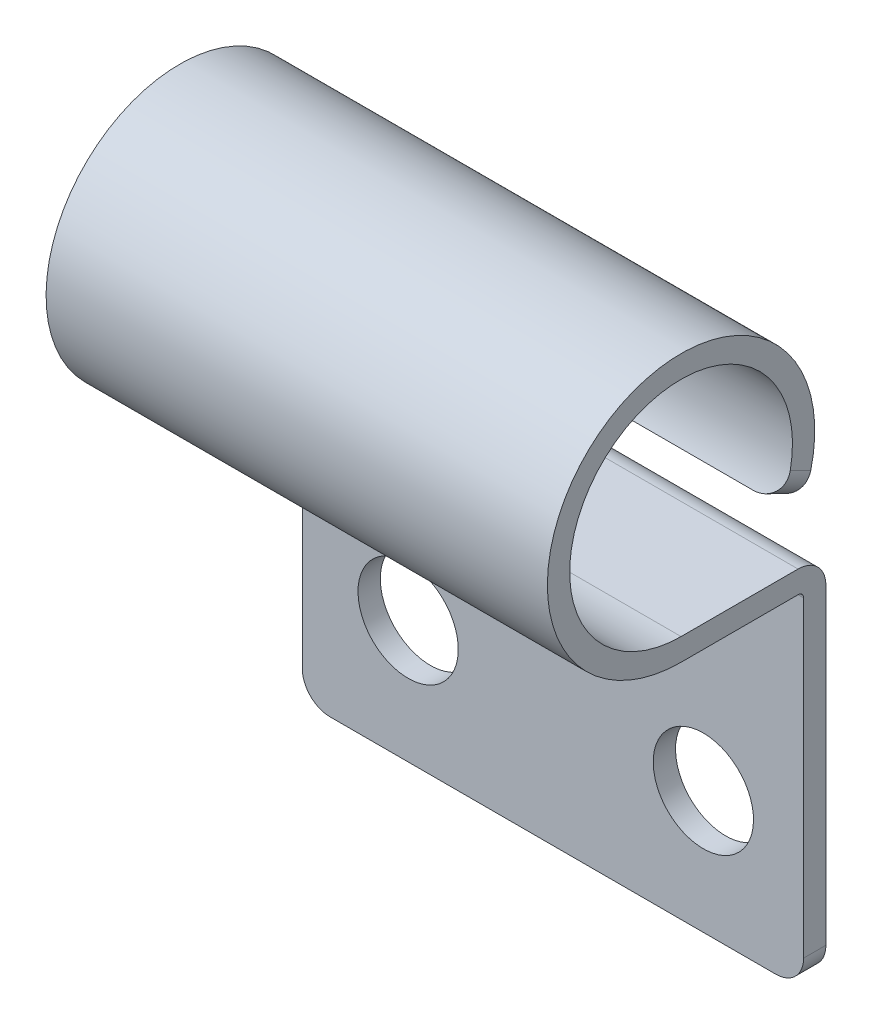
ISO-10303-21;
HEADER;
FILE_DESCRIPTION(('STEP AP214'),'2;1');
FILE_NAME('part.step','',(''),(''),'','','');
FILE_SCHEMA(('AUTOMOTIVE_DESIGN { 1 0 10303 214 1 1 1 1 }'));
ENDSEC;
DATA;
#1=APPLICATION_CONTEXT('core data for automotive mechanical design processes');
#2=APPLICATION_PROTOCOL_DEFINITION('international standard','automotive_design',2000,#1);
#3=PRODUCT_CONTEXT('',#1,'mechanical');
#4=PRODUCT('Part','Part','',(#3));
#5=PRODUCT_RELATED_PRODUCT_CATEGORY('part','',(#4));
#6=PRODUCT_DEFINITION_FORMATION('','',#4);
#7=PRODUCT_DEFINITION_CONTEXT('part definition',#1,'design');
#8=PRODUCT_DEFINITION('design','',#6,#7);
#9=PRODUCT_DEFINITION_SHAPE('','',#8);
#10=(LENGTH_UNIT() NAMED_UNIT(*) SI_UNIT(.MILLI.,.METRE.));
#11=(NAMED_UNIT(*) PLANE_ANGLE_UNIT() SI_UNIT($,.RADIAN.));
#12=(NAMED_UNIT(*) SI_UNIT($,.STERADIAN.) SOLID_ANGLE_UNIT());
#13=UNCERTAINTY_MEASURE_WITH_UNIT(LENGTH_MEASURE(1.E-05),#10,'distance_accuracy_value','');
#14=(GEOMETRIC_REPRESENTATION_CONTEXT(3) GLOBAL_UNCERTAINTY_ASSIGNED_CONTEXT((#13)) GLOBAL_UNIT_ASSIGNED_CONTEXT((#10,
#11,#12)) REPRESENTATION_CONTEXT('',''));
#15=CARTESIAN_POINT('',(0.,0.,0.));
#16=DIRECTION('',(0.,0.,1.));
#17=DIRECTION('',(1.,0.,0.));
#18=AXIS2_PLACEMENT_3D('',#15,#16,#17);
#19=CARTESIAN_POINT('',(9.,-2.5,-2.2));
#20=DIRECTION('',(0.,0.,-1.));
#21=DIRECTION('',(0.,1.,0.));
#22=AXIS2_PLACEMENT_3D('',#19,#20,#21);
#23=PLANE('',#22);
#24=CARTESIAN_POINT('',(4.45,-3.7,-2.2));
#25=DIRECTION('',(0.,0.,-1.));
#26=DIRECTION('',(0.,1.,0.));
#27=AXIS2_PLACEMENT_3D('',#24,#25,#26);
#28=CIRCLE('',#27,0.7);
#29=CARTESIAN_POINT('',(4.45,-3.,-2.2));
#30=VERTEX_POINT('',#29);
#31=EDGE_CURVE('E343',#30,#30,#28,.T.);
#32=ORIENTED_EDGE('',*,*,#31,.T.);
#33=EDGE_LOOP('',(#32));
#34=FACE_BOUND('',#33,.T.);
#35=CARTESIAN_POINT('',(7.2,-6.4,-2.2));
#36=DIRECTION('',(0.,0.,-1.));
#37=DIRECTION('',(0.,1.,0.));
#38=AXIS2_PLACEMENT_3D('',#35,#36,#37);
#39=CIRCLE('',#38,0.899999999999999);
#40=CARTESIAN_POINT('',(7.2,-5.5,-2.2));
#41=VERTEX_POINT('',#40);
#42=EDGE_CURVE('E337',#41,#41,#39,.T.);
#43=ORIENTED_EDGE('',*,*,#42,.T.);
#44=EDGE_LOOP('',(#43));
#45=FACE_BOUND('',#44,.T.);
#46=CARTESIAN_POINT('',(1.9,-6.4,-2.2));
#47=DIRECTION('',(0.,0.,-1.));
#48=DIRECTION('',(0.,1.,0.));
#49=AXIS2_PLACEMENT_3D('',#46,#47,#48);
#50=CIRCLE('',#49,0.9);
#51=CARTESIAN_POINT('',(1.9,-5.5,-2.2));
#52=VERTEX_POINT('',#51);
#53=EDGE_CURVE('E176',#52,#52,#50,.T.);
#54=ORIENTED_EDGE('',*,*,#53,.T.);
#55=EDGE_LOOP('',(#54));
#56=FACE_BOUND('',#55,.T.);
#57=DIRECTION('',(0.,-1.,0.));
#58=VECTOR('',#57,1.);
#59=CARTESIAN_POINT('',(0.,-2.5,-2.2));
#60=LINE('',#59,#58);
#61=CARTESIAN_POINT('',(0.,-2.5,-2.2));
#62=VERTEX_POINT('',#61);
#63=CARTESIAN_POINT('',(0.,-8.1,-2.2));
#64=VERTEX_POINT('',#63);
#65=EDGE_CURVE('E173',#62,#64,#60,.T.);
#66=ORIENTED_EDGE('',*,*,#65,.T.);
#67=CARTESIAN_POINT('',(0.5,-8.1,-2.2));
#68=DIRECTION('',(0.,0.,-1.));
#69=DIRECTION('',(0.,1.,0.));
#70=AXIS2_PLACEMENT_3D('',#67,#68,#69);
#71=CIRCLE('',#70,0.5);
#72=CARTESIAN_POINT('',(0.5,-8.6,-2.2));
#73=VERTEX_POINT('',#72);
#74=EDGE_CURVE('E308',#64,#73,#71,.F.);
#75=ORIENTED_EDGE('',*,*,#74,.T.);
#76=DIRECTION('',(-1.,0.,0.));
#77=VECTOR('',#76,1.);
#78=CARTESIAN_POINT('',(9.,-8.6,-2.2));
#79=LINE('',#78,#77);
#80=CARTESIAN_POINT('',(8.5,-8.6,-2.2));
#81=VERTEX_POINT('',#80);
#82=EDGE_CURVE('E210',#81,#73,#79,.T.);
#83=ORIENTED_EDGE('',*,*,#82,.F.);
#84=CARTESIAN_POINT('',(8.5,-8.1,-2.2));
#85=DIRECTION('',(0.,0.,-1.));
#86=DIRECTION('',(0.,1.,0.));
#87=AXIS2_PLACEMENT_3D('',#84,#85,#86);
#88=CIRCLE('',#87,0.5);
#89=CARTESIAN_POINT('',(9.,-8.1,-2.2));
#90=VERTEX_POINT('',#89);
#91=EDGE_CURVE('E306',#81,#90,#88,.F.);
#92=ORIENTED_EDGE('',*,*,#91,.T.);
#93=DIRECTION('',(0.,-1.,0.));
#94=VECTOR('',#93,1.);
#95=CARTESIAN_POINT('',(9.,-2.5,-2.2));
#96=LINE('',#95,#94);
#97=CARTESIAN_POINT('',(9.,-2.5,-2.2));
#98=VERTEX_POINT('',#97);
#99=EDGE_CURVE('E156',#98,#90,#96,.T.);
#100=ORIENTED_EDGE('',*,*,#99,.F.);
#101=DIRECTION('',(-1.,0.,0.));
#102=VECTOR('',#101,1.);
#103=CARTESIAN_POINT('',(9.,-2.5,-2.2));
#104=LINE('',#103,#102);
#105=EDGE_CURVE('E172',#98,#62,#104,.T.);
#106=ORIENTED_EDGE('',*,*,#105,.T.);
#107=EDGE_LOOP('',(#66,#75,#83,#92,#100,#106));
#108=FACE_BOUND('',#107,.T.);
#109=ADVANCED_FACE('F34',(#34,#45,#56,#108),#23,.F.);
#110=CARTESIAN_POINT('',(9.,-8.6,-2.6));
#111=DIRECTION('',(0.,-1.,0.));
#112=DIRECTION('',(0.,0.,-1.));
#113=AXIS2_PLACEMENT_3D('',#110,#111,#112);
#114=PLANE('',#113);
#115=ORIENTED_EDGE('',*,*,#82,.T.);
#116=DIRECTION('',(0.,0.,1.));
#117=VECTOR('',#116,1.);
#118=CARTESIAN_POINT('',(0.5,-8.6,-2.6));
#119=LINE('',#118,#117);
#120=CARTESIAN_POINT('',(0.5,-8.6,-2.6));
#121=VERTEX_POINT('',#120);
#122=EDGE_CURVE('E49',#73,#121,#119,.F.);
#123=ORIENTED_EDGE('',*,*,#122,.T.);
#124=DIRECTION('',(-1.,0.,0.));
#125=VECTOR('',#124,1.);
#126=CARTESIAN_POINT('',(9.,-8.6,-2.6));
#127=LINE('',#126,#125);
#128=CARTESIAN_POINT('',(8.5,-8.6,-2.6));
#129=VERTEX_POINT('',#128);
#130=EDGE_CURVE('E143',#129,#121,#127,.T.);
#131=ORIENTED_EDGE('',*,*,#130,.F.);
#132=DIRECTION('',(0.,0.,1.));
#133=VECTOR('',#132,1.);
#134=CARTESIAN_POINT('',(8.5,-8.6,-2.2));
#135=LINE('',#134,#133);
#136=EDGE_CURVE('E312',#129,#81,#135,.T.);
#137=ORIENTED_EDGE('',*,*,#136,.T.);
#138=EDGE_LOOP('',(#115,#123,#131,#137));
#139=FACE_BOUND('',#138,.T.);
#140=ADVANCED_FACE('F275',(#139),#114,.T.);
#141=CARTESIAN_POINT('',(9.,-2.5,-2.6));
#142=DIRECTION('',(0.,0.,-1.));
#143=DIRECTION('',(0.,1.,0.));
#144=AXIS2_PLACEMENT_3D('',#141,#142,#143);
#145=PLANE('',#144);
#146=CARTESIAN_POINT('',(4.45,-3.7,-2.6));
#147=DIRECTION('',(0.,0.,-1.));
#148=DIRECTION('',(0.,1.,0.));
#149=AXIS2_PLACEMENT_3D('',#146,#147,#148);
#150=CIRCLE('',#149,0.7);
#151=CARTESIAN_POINT('',(4.45,-3.,-2.6));
#152=VERTEX_POINT('',#151);
#153=EDGE_CURVE('E345',#152,#152,#150,.T.);
#154=ORIENTED_EDGE('',*,*,#153,.F.);
#155=EDGE_LOOP('',(#154));
#156=FACE_BOUND('',#155,.T.);
#157=CARTESIAN_POINT('',(7.2,-6.4,-2.6));
#158=DIRECTION('',(0.,0.,-1.));
#159=DIRECTION('',(0.,1.,0.));
#160=AXIS2_PLACEMENT_3D('',#157,#158,#159);
#161=CIRCLE('',#160,0.899999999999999);
#162=CARTESIAN_POINT('',(7.2,-5.5,-2.6));
#163=VERTEX_POINT('',#162);
#164=EDGE_CURVE('E340',#163,#163,#161,.T.);
#165=ORIENTED_EDGE('',*,*,#164,.F.);
#166=EDGE_LOOP('',(#165));
#167=FACE_BOUND('',#166,.T.);
#168=CARTESIAN_POINT('',(1.9,-6.4,-2.6));
#169=DIRECTION('',(0.,0.,-1.));
#170=DIRECTION('',(0.,1.,0.));
#171=AXIS2_PLACEMENT_3D('',#168,#169,#170);
#172=CIRCLE('',#171,0.9);
#173=CARTESIAN_POINT('',(1.9,-5.5,-2.6));
#174=VERTEX_POINT('',#173);
#175=EDGE_CURVE('E334',#174,#174,#172,.T.);
#176=ORIENTED_EDGE('',*,*,#175,.F.);
#177=EDGE_LOOP('',(#176));
#178=FACE_BOUND('',#177,.T.);
#179=ORIENTED_EDGE('',*,*,#130,.T.);
#180=CARTESIAN_POINT('',(0.5,-8.1,-2.6));
#181=DIRECTION('',(0.,0.,-1.));
#182=DIRECTION('',(0.,1.,0.));
#183=AXIS2_PLACEMENT_3D('',#180,#181,#182);
#184=CIRCLE('',#183,0.5);
#185=CARTESIAN_POINT('',(0.,-8.1,-2.6));
#186=VERTEX_POINT('',#185);
#187=EDGE_CURVE('E11',#121,#186,#184,.T.);
#188=ORIENTED_EDGE('',*,*,#187,.T.);
#189=DIRECTION('',(0.,-1.,0.));
#190=VECTOR('',#189,1.);
#191=CARTESIAN_POINT('',(0.,-2.5,-2.6));
#192=LINE('',#191,#190);
#193=CARTESIAN_POINT('',(0.,-2.5,-2.6));
#194=VERTEX_POINT('',#193);
#195=EDGE_CURVE('E138',#194,#186,#192,.T.);
#196=ORIENTED_EDGE('',*,*,#195,.F.);
#197=DIRECTION('',(-1.,0.,0.));
#198=VECTOR('',#197,1.);
#199=CARTESIAN_POINT('',(9.,-2.5,-2.6));
#200=LINE('',#199,#198);
#201=CARTESIAN_POINT('',(9.,-2.5,-2.6));
#202=VERTEX_POINT('',#201);
#203=EDGE_CURVE('E133',#202,#194,#200,.T.);
#204=ORIENTED_EDGE('',*,*,#203,.F.);
#205=DIRECTION('',(0.,-1.,0.));
#206=VECTOR('',#205,1.);
#207=CARTESIAN_POINT('',(9.,-2.5,-2.6));
#208=LINE('',#207,#206);
#209=CARTESIAN_POINT('',(9.,-8.1,-2.6));
#210=VERTEX_POINT('',#209);
#211=EDGE_CURVE('E136',#202,#210,#208,.T.);
#212=ORIENTED_EDGE('',*,*,#211,.T.);
#213=CARTESIAN_POINT('',(8.5,-8.1,-2.6));
#214=DIRECTION('',(0.,0.,-1.));
#215=DIRECTION('',(0.,1.,0.));
#216=AXIS2_PLACEMENT_3D('',#213,#214,#215);
#217=CIRCLE('',#216,0.5);
#218=EDGE_CURVE('E42',#210,#129,#217,.T.);
#219=ORIENTED_EDGE('',*,*,#218,.T.);
#220=EDGE_LOOP('',(#179,#188,#196,#204,#212,#219));
#221=FACE_BOUND('',#220,.T.);
#222=ADVANCED_FACE('F135',(#156,#167,#178,#221),#145,.T.);
#223=CARTESIAN_POINT('',(9.,-2.5,-2.1));
#224=DIRECTION('',(-1.,0.,0.));
#225=DIRECTION('',(0.,0.,1.));
#226=AXIS2_PLACEMENT_3D('',#223,#224,#225);
#227=CYLINDRICAL_SURFACE('',#226,0.5);
#228=CARTESIAN_POINT('',(0.,-2.5,-2.1));
#229=DIRECTION('',(-1.,0.,0.));
#230=DIRECTION('',(0.,0.,1.));
#231=AXIS2_PLACEMENT_3D('',#228,#229,#230);
#232=CIRCLE('',#231,0.5);
#233=CARTESIAN_POINT('',(0.,-2.,-2.1));
#234=VERTEX_POINT('',#233);
#235=EDGE_CURVE('E178',#234,#194,#232,.T.);
#236=ORIENTED_EDGE('',*,*,#235,.F.);
#237=DIRECTION('',(-1.,0.,0.));
#238=VECTOR('',#237,1.);
#239=CARTESIAN_POINT('',(9.,-2.,-2.1));
#240=LINE('',#239,#238);
#241=CARTESIAN_POINT('',(9.,-2.,-2.1));
#242=VERTEX_POINT('',#241);
#243=EDGE_CURVE('E144',#242,#234,#240,.T.);
#244=ORIENTED_EDGE('',*,*,#243,.F.);
#245=CARTESIAN_POINT('',(9.,-2.5,-2.1));
#246=DIRECTION('',(-1.,0.,0.));
#247=DIRECTION('',(0.,0.,1.));
#248=AXIS2_PLACEMENT_3D('',#245,#246,#247);
#249=CIRCLE('',#248,0.5);
#250=EDGE_CURVE('E151',#242,#202,#249,.T.);
#251=ORIENTED_EDGE('',*,*,#250,.T.);
#252=ORIENTED_EDGE('',*,*,#203,.T.);
#253=EDGE_LOOP('',(#236,#244,#251,#252));
#254=FACE_BOUND('',#253,.T.);
#255=ADVANCED_FACE('F158',(#254),#227,.T.);
#256=CARTESIAN_POINT('',(9.,-2.,0.));
#257=DIRECTION('',(0.,1.,0.));
#258=DIRECTION('',(0.,0.,1.));
#259=AXIS2_PLACEMENT_3D('',#256,#257,#258);
#260=PLANE('',#259);
#261=DIRECTION('',(0.,0.,-1.));
#262=VECTOR('',#261,1.);
#263=CARTESIAN_POINT('',(0.,-2.,0.));
#264=LINE('',#263,#262);
#265=CARTESIAN_POINT('',(0.,-2.,0.));
#266=VERTEX_POINT('',#265);
#267=EDGE_CURVE('E180',#266,#234,#264,.T.);
#268=ORIENTED_EDGE('',*,*,#267,.F.);
#269=DIRECTION('',(-1.,0.,0.));
#270=VECTOR('',#269,1.);
#271=CARTESIAN_POINT('',(9.,-2.,0.));
#272=LINE('',#271,#270);
#273=CARTESIAN_POINT('',(9.,-2.,0.));
#274=VERTEX_POINT('',#273);
#275=EDGE_CURVE('E205',#274,#266,#272,.T.);
#276=ORIENTED_EDGE('',*,*,#275,.F.);
#277=DIRECTION('',(0.,0.,-1.));
#278=VECTOR('',#277,1.);
#279=CARTESIAN_POINT('',(9.,-2.,0.));
#280=LINE('',#279,#278);
#281=EDGE_CURVE('E159',#274,#242,#280,.T.);
#282=ORIENTED_EDGE('',*,*,#281,.T.);
#283=ORIENTED_EDGE('',*,*,#243,.T.);
#284=EDGE_LOOP('',(#268,#276,#282,#283));
#285=FACE_BOUND('',#284,.T.);
#286=ADVANCED_FACE('F272',(#285),#260,.T.);
#287=CARTESIAN_POINT('',(9.,0.,0.));
#288=DIRECTION('',(-1.,0.,0.));
#289=DIRECTION('',(0.,0.,1.));
#290=AXIS2_PLACEMENT_3D('',#287,#288,#289);
#291=CYLINDRICAL_SURFACE('',#290,2.);
#292=CARTESIAN_POINT('',(0.,0.,0.));
#293=DIRECTION('',(1.,0.,0.));
#294=DIRECTION('',(0.,0.,-1.));
#295=AXIS2_PLACEMENT_3D('',#292,#293,#294);
#296=CIRCLE('',#295,2.);
#297=CARTESIAN_POINT('',(0.,-0.399438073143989,-1.95970641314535));
#298=VERTEX_POINT('',#297);
#299=EDGE_CURVE('E183',#298,#266,#296,.T.);
#300=ORIENTED_EDGE('',*,*,#299,.F.);
#301=CARTESIAN_POINT('',(0.,-0.399438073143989,-1.95970641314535));
#302=CARTESIAN_POINT('',(-2.8812266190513E-05,-0.426918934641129,-1.95412802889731));
#303=CARTESIAN_POINT('',(0.00220990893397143,-0.45428363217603,-1.94792633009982));
#304=CARTESIAN_POINT('',(0.0111747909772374,-0.508024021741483,-1.93459398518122));
#305=CARTESIAN_POINT('',(0.0178996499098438,-0.534399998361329,-1.92746360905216));
#306=CARTESIAN_POINT('',(0.035802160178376,-0.585459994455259,-1.91257722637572));
#307=CARTESIAN_POINT('',(0.0469862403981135,-0.610141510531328,-1.90482032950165));
#308=CARTESIAN_POINT('',(0.0735320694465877,-0.657070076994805,-1.88914524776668));
#309=CARTESIAN_POINT('',(0.0888917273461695,-0.679318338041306,-1.88122714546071));
#310=CARTESIAN_POINT('',(0.123093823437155,-0.720479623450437,-1.86584714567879));
#311=CARTESIAN_POINT('',(0.141876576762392,-0.739440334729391,-1.85837997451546));
#312=CARTESIAN_POINT('',(0.182565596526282,-0.774025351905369,-1.84424363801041));
#313=CARTESIAN_POINT('',(0.204472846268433,-0.789648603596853,-1.83757472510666));
#314=CARTESIAN_POINT('',(0.250946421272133,-0.817316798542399,-1.8254379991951));
#315=CARTESIAN_POINT('',(0.275529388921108,-0.829337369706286,-1.81997842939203));
#316=CARTESIAN_POINT('',(0.32654351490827,-0.849424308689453,-1.81069082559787));
#317=CARTESIAN_POINT('',(0.352973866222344,-0.857492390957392,-1.80686208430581));
#318=CARTESIAN_POINT('',(0.399578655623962,-0.867891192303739,-1.80188484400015));
#319=CARTESIAN_POINT('',(0.419497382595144,-0.871185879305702,-1.80029044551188));
#320=CARTESIAN_POINT('',(0.459608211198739,-0.875580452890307,-1.79815468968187));
#321=CARTESIAN_POINT('',(0.479799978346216,-0.87668281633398,-1.79761214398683));
#322=CARTESIAN_POINT('',(0.5,-0.8766808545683,-1.79761805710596));
#323=B_SPLINE_CURVE_WITH_KNOTS('',3,(#301,#302,#303,#304,#305,#306,#307,#308,#309,#310,#311,
#312,#313,#314,#315,#316,#317,#318,#319,#320,#321,#322),.UNSPECIFIED.,.F.,.F.,(4,2,2,2,2,2,2,2,
2,2,4),(0.,0.0840428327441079,0.168061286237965,0.252201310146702,0.336299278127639,
0.419051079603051,0.501828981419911,0.585154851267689,0.668444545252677,0.729060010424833,
0.789606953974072),.UNSPECIFIED.);
#324=CARTESIAN_POINT('',(0.5,-0.8766808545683,-1.79761805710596));
#325=VERTEX_POINT('',#324);
#326=EDGE_CURVE('E225',#298,#325,#323,.T.);
#327=ORIENTED_EDGE('',*,*,#326,.T.);
#328=DIRECTION('',(-1.,0.,0.));
#329=VECTOR('',#328,1.);
#330=CARTESIAN_POINT('',(9.,-0.8766808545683,-1.79761805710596));
#331=LINE('',#330,#329);
#332=CARTESIAN_POINT('',(8.5,-0.8766808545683,-1.79761805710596));
#333=VERTEX_POINT('',#332);
#334=EDGE_CURVE('E202',#333,#325,#331,.T.);
#335=ORIENTED_EDGE('',*,*,#334,.F.);
#336=CARTESIAN_POINT('',(8.5,-0.8766808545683,-1.79761805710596));
#337=CARTESIAN_POINT('',(8.52811167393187,-0.876694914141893,-1.7975924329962));
#338=CARTESIAN_POINT('',(8.55621639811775,-0.874551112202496,-1.7986563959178));
#339=CARTESIAN_POINT('',(8.61161328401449,-0.866050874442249,-1.80277452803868));
#340=CARTESIAN_POINT('',(8.63890598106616,-0.859697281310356,-1.80582735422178));
#341=CARTESIAN_POINT('',(8.69193382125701,-0.842875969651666,-1.81373675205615));
#342=CARTESIAN_POINT('',(8.71766815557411,-0.832406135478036,-1.81859425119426));
#343=CARTESIAN_POINT('',(8.76682744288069,-0.807559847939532,-1.82976313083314));
#344=CARTESIAN_POINT('',(8.79025278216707,-0.793184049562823,-1.83607426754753));
#345=CARTESIAN_POINT('',(8.83406712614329,-0.760864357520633,-1.84970021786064));
#346=CARTESIAN_POINT('',(8.85446390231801,-0.742929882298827,-1.85701236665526));
#347=CARTESIAN_POINT('',(8.89170634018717,-0.703877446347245,-1.87216295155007));
#348=CARTESIAN_POINT('',(8.90855222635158,-0.682759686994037,-1.88000135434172));
#349=CARTESIAN_POINT('',(8.93806150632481,-0.638114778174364,-1.89561657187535));
#350=CARTESIAN_POINT('',(8.95076759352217,-0.614615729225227,-1.90339315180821));
#351=CARTESIAN_POINT('',(8.97192694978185,-0.56564482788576,-1.91851540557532));
#352=CARTESIAN_POINT('',(8.98038090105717,-0.540173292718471,-1.92586114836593));
#353=CARTESIAN_POINT('',(8.99110536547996,-0.495424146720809,-1.9377636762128));
#354=CARTESIAN_POINT('',(8.99445113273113,-0.476448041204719,-1.94251901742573));
#355=CARTESIAN_POINT('',(8.99889883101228,-0.438148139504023,-1.95151665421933));
#356=CARTESIAN_POINT('',(9.00000448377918,-0.418824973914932,-1.95575978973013));
#357=CARTESIAN_POINT('',(9.,-0.399438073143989,-1.95970641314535));
#358=B_SPLINE_CURVE_WITH_KNOTS('',3,(#336,#337,#338,#339,#340,#341,#342,#343,#344,#345,#346,
#347,#348,#349,#350,#351,#352,#353,#354,#355,#356,#357),.UNSPECIFIED.,.F.,.F.,(4,2,2,2,2,2,2,2,
2,2,4),(0.,0.0842234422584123,0.168390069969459,0.25260001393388,0.336795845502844,
0.420771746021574,0.50474233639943,0.587817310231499,0.670878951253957,0.730289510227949,
0.789601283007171),.UNSPECIFIED.);
#359=CARTESIAN_POINT('',(9.,-0.399438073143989,-1.95970641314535));
#360=VERTEX_POINT('',#359);
#361=EDGE_CURVE('E218',#333,#360,#358,.T.);
#362=ORIENTED_EDGE('',*,*,#361,.T.);
#363=CARTESIAN_POINT('',(9.,0.,0.));
#364=DIRECTION('',(1.,0.,0.));
#365=DIRECTION('',(0.,0.,-1.));
#366=AXIS2_PLACEMENT_3D('',#363,#364,#365);
#367=CIRCLE('',#366,2.);
#368=EDGE_CURVE('E161',#360,#274,#367,.T.);
#369=ORIENTED_EDGE('',*,*,#368,.T.);
#370=ORIENTED_EDGE('',*,*,#275,.T.);
#371=EDGE_LOOP('',(#300,#327,#335,#362,#369,#370));
#372=FACE_BOUND('',#371,.T.);
#373=ADVANCED_FACE('F231',(#372),#291,.F.);
#374=CARTESIAN_POINT('',(9.,-1.05201702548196,-2.15714166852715));
#375=DIRECTION('',(0.,-0.898809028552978,0.43834042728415));
#376=DIRECTION('',(0.,-0.438340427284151,-0.898809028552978));
#377=AXIS2_PLACEMENT_3D('',#374,#375,#376);
#378=PLANE('',#377);
#379=ORIENTED_EDGE('',*,*,#334,.T.);
#380=DIRECTION('',(0.,0.438340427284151,0.898809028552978));
#381=VECTOR('',#380,1.);
#382=CARTESIAN_POINT('',(0.5,-1.05201702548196,-2.15714166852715));
#383=LINE('',#382,#381);
#384=CARTESIAN_POINT('',(0.5,-1.05201702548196,-2.15714166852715));
#385=VERTEX_POINT('',#384);
#386=EDGE_CURVE('E253',#325,#385,#383,.F.);
#387=ORIENTED_EDGE('',*,*,#386,.T.);
#388=DIRECTION('',(-1.,0.,0.));
#389=VECTOR('',#388,1.);
#390=CARTESIAN_POINT('',(9.,-1.05201702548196,-2.15714166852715));
#391=LINE('',#390,#389);
#392=CARTESIAN_POINT('',(8.5,-1.05201702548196,-2.15714166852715));
#393=VERTEX_POINT('',#392);
#394=EDGE_CURVE('E199',#393,#385,#391,.T.);
#395=ORIENTED_EDGE('',*,*,#394,.F.);
#396=DIRECTION('',(0.,0.438340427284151,0.898809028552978));
#397=VECTOR('',#396,1.);
#398=CARTESIAN_POINT('',(8.5,-0.8766808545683,-1.79761805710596));
#399=LINE('',#398,#397);
#400=EDGE_CURVE('E385',#393,#333,#399,.T.);
#401=ORIENTED_EDGE('',*,*,#400,.T.);
#402=EDGE_LOOP('',(#379,#387,#395,#401));
#403=FACE_BOUND('',#402,.T.);
#404=ADVANCED_FACE('F263',(#403),#378,.T.);
#405=CARTESIAN_POINT('',(9.,0.,0.));
#406=DIRECTION('',(-1.,0.,0.));
#407=DIRECTION('',(0.,0.,1.));
#408=AXIS2_PLACEMENT_3D('',#405,#406,#407);
#409=CYLINDRICAL_SURFACE('',#408,2.4);
#410=ORIENTED_EDGE('',*,*,#394,.T.);
#411=CARTESIAN_POINT('',(0.5,-1.05201702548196,-2.15714166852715));
#412=CARTESIAN_POINT('',(0.471882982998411,-1.05203231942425,-2.15711856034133));
#413=CARTESIAN_POINT('',(0.443772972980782,-1.04988649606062,-2.1581804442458));
#414=CARTESIAN_POINT('',(0.388366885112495,-1.04138500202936,-2.16230372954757));
#415=CARTESIAN_POINT('',(0.361070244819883,-1.03503231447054,-2.16536371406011));
#416=CARTESIAN_POINT('',(0.30803540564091,-1.01822495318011,-2.17331518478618));
#417=CARTESIAN_POINT('',(0.282297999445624,-1.00776821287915,-2.17820759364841));
#418=CARTESIAN_POINT('',(0.233132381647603,-0.982976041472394,-2.1895077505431));
#419=CARTESIAN_POINT('',(0.209703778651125,-0.96864126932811,-2.19591524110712));
#420=CARTESIAN_POINT('',(0.165862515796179,-0.936434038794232,-2.20984100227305));
#421=CARTESIAN_POINT('',(0.145444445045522,-0.918568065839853,-2.21735723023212));
#422=CARTESIAN_POINT('',(0.108157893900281,-0.879699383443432,-2.23306232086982));
#423=CARTESIAN_POINT('',(0.0912894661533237,-0.858696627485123,-2.24125119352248));
#424=CARTESIAN_POINT('',(0.0616889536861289,-0.814254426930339,-2.25777479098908));
#425=CARTESIAN_POINT('',(0.04892722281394,-0.790834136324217,-2.26610799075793));
#426=CARTESIAN_POINT('',(0.0277016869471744,-0.742048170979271,-2.28254805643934));
#427=CARTESIAN_POINT('',(0.0192366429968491,-0.716683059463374,-2.29065498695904));
#428=CARTESIAN_POINT('',(0.00866524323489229,-0.67260109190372,-2.30390229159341));
#429=CARTESIAN_POINT('',(0.00540964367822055,-0.654196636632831,-2.30919767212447));
#430=CARTESIAN_POINT('',(0.00107687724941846,-0.617058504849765,-2.31939934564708));
#431=CARTESIAN_POINT('',(-3.7487074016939E-06,-0.598325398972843,-2.32430624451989));
#432=CARTESIAN_POINT('',(0.,-0.5795290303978,-2.32897962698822));
#433=B_SPLINE_CURVE_WITH_KNOTS('',3,(#411,#412,#413,#414,#415,#416,#417,#418,#419,#420,#421,
#422,#423,#424,#425,#426,#427,#428,#429,#430,#431,#432),.UNSPECIFIED.,.F.,.F.,(4,2,2,2,2,2,2,2,
2,2,4),(0.,0.0842393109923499,0.168418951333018,0.252641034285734,0.336848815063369,
0.420903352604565,0.504959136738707,0.588393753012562,0.671804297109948,0.729959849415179,
0.788022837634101),.UNSPECIFIED.);
#434=CARTESIAN_POINT('',(0.,-0.579529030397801,-2.32897962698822));
#435=VERTEX_POINT('',#434);
#436=EDGE_CURVE('E252',#385,#435,#433,.T.);
#437=ORIENTED_EDGE('',*,*,#436,.T.);
#438=CARTESIAN_POINT('',(0.,0.,0.));
#439=DIRECTION('',(1.,0.,0.));
#440=DIRECTION('',(0.,0.,-1.));
#441=AXIS2_PLACEMENT_3D('',#438,#439,#440);
#442=CIRCLE('',#441,2.4);
#443=CARTESIAN_POINT('',(0.,-2.4,0.));
#444=VERTEX_POINT('',#443);
#445=EDGE_CURVE('E185',#435,#444,#442,.T.);
#446=ORIENTED_EDGE('',*,*,#445,.T.);
#447=DIRECTION('',(-1.,0.,0.));
#448=VECTOR('',#447,1.);
#449=CARTESIAN_POINT('',(9.,-2.4,0.));
#450=LINE('',#449,#448);
#451=CARTESIAN_POINT('',(9.,-2.4,0.));
#452=VERTEX_POINT('',#451);
#453=EDGE_CURVE('E196',#452,#444,#450,.T.);
#454=ORIENTED_EDGE('',*,*,#453,.F.);
#455=CARTESIAN_POINT('',(9.,0.,0.));
#456=DIRECTION('',(1.,0.,0.));
#457=DIRECTION('',(0.,0.,-1.));
#458=AXIS2_PLACEMENT_3D('',#455,#456,#457);
#459=CIRCLE('',#458,2.4);
#460=CARTESIAN_POINT('',(9.,-0.579529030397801,-2.32897962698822));
#461=VERTEX_POINT('',#460);
#462=EDGE_CURVE('E166',#461,#452,#459,.T.);
#463=ORIENTED_EDGE('',*,*,#462,.F.);
#464=CARTESIAN_POINT('',(9.,-0.579529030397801,-2.32897962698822));
#465=CARTESIAN_POINT('',(9.000027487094,-0.606770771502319,-2.32222036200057));
#466=CARTESIAN_POINT('',(8.9977407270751,-0.633889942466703,-2.31494597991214));
#467=CARTESIAN_POINT('',(8.98862528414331,-0.687135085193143,-2.29969299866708));
#468=CARTESIAN_POINT('',(8.981798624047,-0.713261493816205,-2.2917147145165));
#469=CARTESIAN_POINT('',(8.96367934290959,-0.763827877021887,-2.27536389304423));
#470=CARTESIAN_POINT('',(8.95238156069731,-0.788265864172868,-2.26699090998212));
#471=CARTESIAN_POINT('',(8.92561508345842,-0.834742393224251,-2.25029192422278));
#472=CARTESIAN_POINT('',(8.91014805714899,-0.856781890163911,-2.24196590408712));
#473=CARTESIAN_POINT('',(8.87566409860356,-0.89766807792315,-2.22590890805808));
#474=CARTESIAN_POINT('',(8.85668887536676,-0.91654777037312,-2.21817231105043));
#475=CARTESIAN_POINT('',(8.81560285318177,-0.950971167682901,-2.20363422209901));
#476=CARTESIAN_POINT('',(8.79349117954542,-0.966513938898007,-2.19683299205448));
#477=CARTESIAN_POINT('',(8.74664624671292,-0.993981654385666,-2.18454316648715));
#478=CARTESIAN_POINT('',(8.72190088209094,-1.00588882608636,-2.17906104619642));
#479=CARTESIAN_POINT('',(8.67057533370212,-1.02573273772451,-2.16979096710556));
#480=CARTESIAN_POINT('',(8.64399603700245,-1.03367138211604,-2.16600219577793));
#481=CARTESIAN_POINT('',(8.59775077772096,-1.04369446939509,-2.16118563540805));
#482=CARTESIAN_POINT('',(8.57835150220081,-1.04681410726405,-2.15967349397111));
#483=CARTESIAN_POINT('',(8.53930402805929,-1.05097503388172,-2.15764983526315));
#484=CARTESIAN_POINT('',(8.51965616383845,-1.052018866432,-2.15713709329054));
#485=CARTESIAN_POINT('',(8.5,-1.05201702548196,-2.15714166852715));
#486=B_SPLINE_CURVE_WITH_KNOTS('',3,(#464,#465,#466,#467,#468,#469,#470,#471,#472,#473,#474,
#475,#476,#477,#478,#479,#480,#481,#482,#483,#484,#485),.UNSPECIFIED.,.F.,.F.,(4,2,2,2,2,2,2,2,
2,2,4),(0.,0.0841130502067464,0.16818864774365,0.252361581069,0.336500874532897,
0.419697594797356,0.502917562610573,0.586538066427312,0.670118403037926,0.729108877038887,
0.78802701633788),.UNSPECIFIED.);
#487=EDGE_CURVE('E245',#461,#393,#486,.T.);
#488=ORIENTED_EDGE('',*,*,#487,.T.);
#489=EDGE_LOOP('',(#410,#437,#446,#454,#463,#488));
#490=FACE_BOUND('',#489,.T.);
#491=ADVANCED_FACE('F258',(#490),#409,.T.);
#492=CARTESIAN_POINT('',(9.,-2.4,0.));
#493=DIRECTION('',(0.,1.,0.));
#494=DIRECTION('',(0.,0.,1.));
#495=AXIS2_PLACEMENT_3D('',#492,#493,#494);
#496=PLANE('',#495);
#497=DIRECTION('',(0.,0.,-1.));
#498=VECTOR('',#497,1.);
#499=CARTESIAN_POINT('',(0.,-2.4,0.));
#500=LINE('',#499,#498);
#501=CARTESIAN_POINT('',(0.,-2.4,-2.1));
#502=VERTEX_POINT('',#501);
#503=EDGE_CURVE('E187',#444,#502,#500,.T.);
#504=ORIENTED_EDGE('',*,*,#503,.T.);
#505=DIRECTION('',(-1.,0.,0.));
#506=VECTOR('',#505,1.);
#507=CARTESIAN_POINT('',(9.,-2.4,-2.1));
#508=LINE('',#507,#506);
#509=CARTESIAN_POINT('',(9.,-2.4,-2.1));
#510=VERTEX_POINT('',#509);
#511=EDGE_CURVE('E193',#510,#502,#508,.T.);
#512=ORIENTED_EDGE('',*,*,#511,.F.);
#513=DIRECTION('',(0.,0.,-1.));
#514=VECTOR('',#513,1.);
#515=CARTESIAN_POINT('',(9.,-2.4,0.));
#516=LINE('',#515,#514);
#517=EDGE_CURVE('E168',#452,#510,#516,.T.);
#518=ORIENTED_EDGE('',*,*,#517,.F.);
#519=ORIENTED_EDGE('',*,*,#453,.T.);
#520=EDGE_LOOP('',(#504,#512,#518,#519));
#521=FACE_BOUND('',#520,.T.);
#522=ADVANCED_FACE('F262',(#521),#496,.F.);
#523=CARTESIAN_POINT('',(9.,-2.5,-2.1));
#524=DIRECTION('',(-1.,0.,0.));
#525=DIRECTION('',(0.,0.,1.));
#526=AXIS2_PLACEMENT_3D('',#523,#524,#525);
#527=CYLINDRICAL_SURFACE('',#526,0.1);
#528=CARTESIAN_POINT('',(0.,-2.5,-2.1));
#529=DIRECTION('',(1.,0.,0.));
#530=DIRECTION('',(0.,0.,-1.));
#531=AXIS2_PLACEMENT_3D('',#528,#529,#530);
#532=CIRCLE('',#531,0.1);
#533=EDGE_CURVE('E189',#502,#62,#532,.F.);
#534=ORIENTED_EDGE('',*,*,#533,.T.);
#535=ORIENTED_EDGE('',*,*,#105,.F.);
#536=CARTESIAN_POINT('',(9.,-2.5,-2.1));
#537=DIRECTION('',(1.,0.,0.));
#538=DIRECTION('',(0.,0.,-1.));
#539=AXIS2_PLACEMENT_3D('',#536,#537,#538);
#540=CIRCLE('',#539,0.1);
#541=EDGE_CURVE('E170',#510,#98,#540,.F.);
#542=ORIENTED_EDGE('',*,*,#541,.F.);
#543=ORIENTED_EDGE('',*,*,#511,.T.);
#544=EDGE_LOOP('',(#534,#535,#542,#543));
#545=FACE_BOUND('',#544,.T.);
#546=ADVANCED_FACE('F328',(#545),#527,.F.);
#547=CARTESIAN_POINT('',(9.,-2.5,-2.1));
#548=DIRECTION('',(-1.,0.,0.));
#549=DIRECTION('',(0.,0.,1.));
#550=AXIS2_PLACEMENT_3D('',#547,#548,#549);
#551=PLANE('',#550);
#552=ORIENTED_EDGE('',*,*,#368,.F.);
#553=DIRECTION('',(0.,0.438340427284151,0.898809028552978));
#554=VECTOR('',#553,1.);
#555=CARTESIAN_POINT('',(9.,-0.602612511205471,-2.37631188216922));
#556=LINE('',#555,#554);
#557=EDGE_CURVE('E301',#360,#461,#556,.F.);
#558=ORIENTED_EDGE('',*,*,#557,.T.);
#559=ORIENTED_EDGE('',*,*,#462,.T.);
#560=ORIENTED_EDGE('',*,*,#517,.T.);
#561=ORIENTED_EDGE('',*,*,#541,.T.);
#562=ORIENTED_EDGE('',*,*,#99,.T.);
#563=DIRECTION('',(0.,0.,1.));
#564=VECTOR('',#563,1.);
#565=CARTESIAN_POINT('',(9.,-8.1,-2.6));
#566=LINE('',#565,#564);
#567=EDGE_CURVE('E155',#90,#210,#566,.F.);
#568=ORIENTED_EDGE('',*,*,#567,.T.);
#569=ORIENTED_EDGE('',*,*,#211,.F.);
#570=ORIENTED_EDGE('',*,*,#250,.F.);
#571=ORIENTED_EDGE('',*,*,#281,.F.);
#572=EDGE_LOOP('',(#552,#558,#559,#560,#561,#562,#568,#569,#570,#571));
#573=FACE_BOUND('',#572,.T.);
#574=ADVANCED_FACE('F149',(#573),#551,.F.);
#575=CARTESIAN_POINT('',(0.,-2.5,-2.1));
#576=DIRECTION('',(-1.,0.,0.));
#577=DIRECTION('',(0.,0.,1.));
#578=AXIS2_PLACEMENT_3D('',#575,#576,#577);
#579=PLANE('',#578);
#580=ORIENTED_EDGE('',*,*,#445,.F.);
#581=DIRECTION('',(0.,0.438340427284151,0.898809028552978));
#582=VECTOR('',#581,1.);
#583=CARTESIAN_POINT('',(0.,-0.858318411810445,-2.90063215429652));
#584=LINE('',#583,#582);
#585=EDGE_CURVE('E215',#435,#298,#584,.T.);
#586=ORIENTED_EDGE('',*,*,#585,.T.);
#587=ORIENTED_EDGE('',*,*,#299,.T.);
#588=ORIENTED_EDGE('',*,*,#267,.T.);
#589=ORIENTED_EDGE('',*,*,#235,.T.);
#590=ORIENTED_EDGE('',*,*,#195,.T.);
#591=DIRECTION('',(0.,0.,1.));
#592=VECTOR('',#591,1.);
#593=CARTESIAN_POINT('',(0.,-8.1,-2.1));
#594=LINE('',#593,#592);
#595=EDGE_CURVE('E212',#186,#64,#594,.T.);
#596=ORIENTED_EDGE('',*,*,#595,.T.);
#597=ORIENTED_EDGE('',*,*,#65,.F.);
#598=ORIENTED_EDGE('',*,*,#533,.F.);
#599=ORIENTED_EDGE('',*,*,#503,.F.);
#600=EDGE_LOOP('',(#580,#586,#587,#588,#589,#590,#596,#597,#598,#599));
#601=FACE_BOUND('',#600,.T.);
#602=ADVANCED_FACE('F296',(#601),#579,.T.);
#603=CARTESIAN_POINT('',(1.9,-6.4,2.4));
#604=DIRECTION('',(0.,0.,-1.));
#605=DIRECTION('',(0.,1.,0.));
#606=AXIS2_PLACEMENT_3D('',#603,#604,#605);
#607=CYLINDRICAL_SURFACE('',#606,0.9);
#608=ORIENTED_EDGE('',*,*,#175,.T.);
#609=EDGE_LOOP('',(#608));
#610=FACE_BOUND('',#609,.T.);
#611=ORIENTED_EDGE('',*,*,#53,.F.);
#612=EDGE_LOOP('',(#611));
#613=FACE_BOUND('',#612,.T.);
#614=ADVANCED_FACE('F356',(#610,#613),#607,.F.);
#615=CARTESIAN_POINT('',(7.2,-6.4,2.4));
#616=DIRECTION('',(0.,0.,-1.));
#617=DIRECTION('',(0.,1.,0.));
#618=AXIS2_PLACEMENT_3D('',#615,#616,#617);
#619=CYLINDRICAL_SURFACE('',#618,0.899999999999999);
#620=ORIENTED_EDGE('',*,*,#164,.T.);
#621=EDGE_LOOP('',(#620));
#622=FACE_BOUND('',#621,.T.);
#623=ORIENTED_EDGE('',*,*,#42,.F.);
#624=EDGE_LOOP('',(#623));
#625=FACE_BOUND('',#624,.T.);
#626=ADVANCED_FACE('F359',(#622,#625),#619,.F.);
#627=CARTESIAN_POINT('',(4.45,-3.7,2.4));
#628=DIRECTION('',(0.,0.,-1.));
#629=DIRECTION('',(0.,1.,0.));
#630=AXIS2_PLACEMENT_3D('',#627,#628,#629);
#631=CYLINDRICAL_SURFACE('',#630,0.7);
#632=ORIENTED_EDGE('',*,*,#153,.T.);
#633=EDGE_LOOP('',(#632));
#634=FACE_BOUND('',#633,.T.);
#635=ORIENTED_EDGE('',*,*,#31,.F.);
#636=EDGE_LOOP('',(#635));
#637=FACE_BOUND('',#636,.T.);
#638=ADVANCED_FACE('F349',(#634,#637),#631,.F.);
#639=CARTESIAN_POINT('',(0.5,-0.858318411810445,-2.90063215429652));
#640=DIRECTION('',(0.,0.438340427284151,0.898809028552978));
#641=DIRECTION('',(0.,-0.898809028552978,0.43834042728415));
#642=AXIS2_PLACEMENT_3D('',#639,#640,#641);
#643=CYLINDRICAL_SURFACE('',#642,0.5);
#644=ORIENTED_EDGE('',*,*,#436,.F.);
#645=ORIENTED_EDGE('',*,*,#386,.F.);
#646=ORIENTED_EDGE('',*,*,#326,.F.);
#647=ORIENTED_EDGE('',*,*,#585,.F.);
#648=EDGE_LOOP('',(#644,#645,#646,#647));
#649=FACE_BOUND('',#648,.T.);
#650=ADVANCED_FACE('F239',(#649),#643,.T.);
#651=CARTESIAN_POINT('',(8.5,-0.602612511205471,-2.37631188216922));
#652=DIRECTION('',(0.,-0.438340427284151,-0.898809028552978));
#653=DIRECTION('',(0.,0.898809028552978,-0.43834042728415));
#654=AXIS2_PLACEMENT_3D('',#651,#652,#653);
#655=CYLINDRICAL_SURFACE('',#654,0.5);
#656=ORIENTED_EDGE('',*,*,#487,.F.);
#657=ORIENTED_EDGE('',*,*,#557,.F.);
#658=ORIENTED_EDGE('',*,*,#361,.F.);
#659=ORIENTED_EDGE('',*,*,#400,.F.);
#660=EDGE_LOOP('',(#656,#657,#658,#659));
#661=FACE_BOUND('',#660,.T.);
#662=ADVANCED_FACE('F235',(#661),#655,.T.);
#663=CARTESIAN_POINT('',(0.5,-8.1,-2.1));
#664=DIRECTION('',(0.,0.,1.));
#665=DIRECTION('',(1.,0.,0.));
#666=AXIS2_PLACEMENT_3D('',#663,#664,#665);
#667=CYLINDRICAL_SURFACE('',#666,0.5);
#668=ORIENTED_EDGE('',*,*,#187,.F.);
#669=ORIENTED_EDGE('',*,*,#122,.F.);
#670=ORIENTED_EDGE('',*,*,#74,.F.);
#671=ORIENTED_EDGE('',*,*,#595,.F.);
#672=EDGE_LOOP('',(#668,#669,#670,#671));
#673=FACE_BOUND('',#672,.T.);
#674=ADVANCED_FACE('F238',(#673),#667,.T.);
#675=CARTESIAN_POINT('',(8.5,-8.1,-2.6));
#676=DIRECTION('',(0.,0.,-1.));
#677=DIRECTION('',(-1.,0.,0.));
#678=AXIS2_PLACEMENT_3D('',#675,#676,#677);
#679=CYLINDRICAL_SURFACE('',#678,0.5);
#680=ORIENTED_EDGE('',*,*,#218,.F.);
#681=ORIENTED_EDGE('',*,*,#567,.F.);
#682=ORIENTED_EDGE('',*,*,#91,.F.);
#683=ORIENTED_EDGE('',*,*,#136,.F.);
#684=EDGE_LOOP('',(#680,#681,#682,#683));
#685=FACE_BOUND('',#684,.T.);
#686=ADVANCED_FACE('F36',(#685),#679,.T.);
#687=CLOSED_SHELL('',(#109,#140,#222,#255,#286,#373,#404,#491,#522,#546,#574,#602,#614,#626,
#638,#650,#662,#674,#686));
#688=MANIFOLD_SOLID_BREP('B2',#687);
#689=ADVANCED_BREP_SHAPE_REPRESENTATION('',(#18,#688),#14);
#690=SHAPE_DEFINITION_REPRESENTATION(#9,#689);
ENDSEC;
END-ISO-10303-21;
